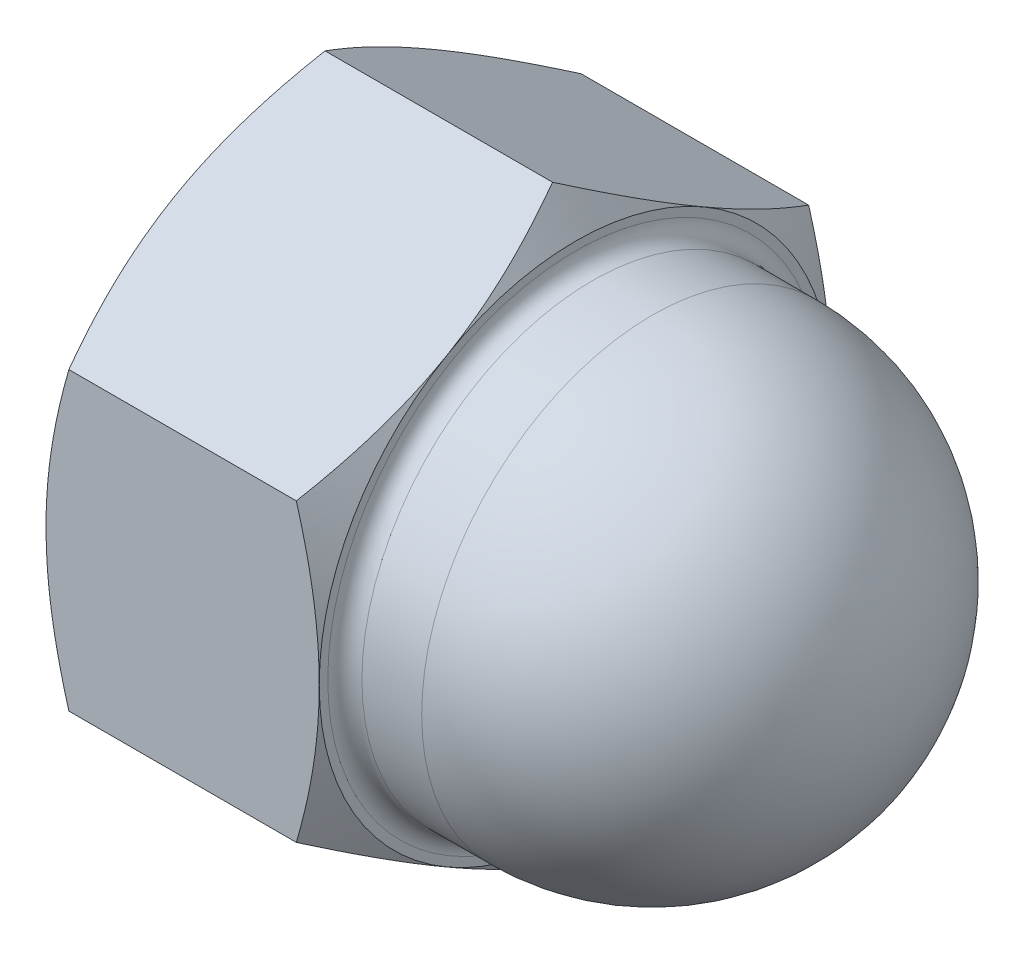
ISO-10303-21;
HEADER;
FILE_DESCRIPTION(('STEP AP214'),'2;1');
FILE_NAME('part.step','',(''),(''),'','','');
FILE_SCHEMA(('AUTOMOTIVE_DESIGN { 1 0 10303 214 1 1 1 1 }'));
ENDSEC;
DATA;
#1=APPLICATION_CONTEXT('core data for automotive mechanical design processes');
#2=APPLICATION_PROTOCOL_DEFINITION('international standard','automotive_design',2000,#1);
#3=PRODUCT_CONTEXT('',#1,'mechanical');
#4=PRODUCT('Part','Part','',(#3));
#5=PRODUCT_RELATED_PRODUCT_CATEGORY('part','',(#4));
#6=PRODUCT_DEFINITION_FORMATION('','',#4);
#7=PRODUCT_DEFINITION_CONTEXT('part definition',#1,'design');
#8=PRODUCT_DEFINITION('design','',#6,#7);
#9=PRODUCT_DEFINITION_SHAPE('','',#8);
#10=(LENGTH_UNIT() NAMED_UNIT(*) SI_UNIT(.MILLI.,.METRE.));
#11=(NAMED_UNIT(*) PLANE_ANGLE_UNIT() SI_UNIT($,.RADIAN.));
#12=(NAMED_UNIT(*) SI_UNIT($,.STERADIAN.) SOLID_ANGLE_UNIT());
#13=UNCERTAINTY_MEASURE_WITH_UNIT(LENGTH_MEASURE(1.E-05),#10,'distance_accuracy_value','');
#14=(GEOMETRIC_REPRESENTATION_CONTEXT(3) GLOBAL_UNCERTAINTY_ASSIGNED_CONTEXT((#13)) GLOBAL_UNIT_ASSIGNED_CONTEXT((#10,
#11,#12)) REPRESENTATION_CONTEXT('',''));
#15=CARTESIAN_POINT('',(0.,0.,0.));
#16=DIRECTION('',(0.,0.,1.));
#17=DIRECTION('',(1.,0.,0.));
#18=AXIS2_PLACEMENT_3D('',#15,#16,#17);
#19=CARTESIAN_POINT('',(16.,17.3205080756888,0.));
#20=DIRECTION('',(-1.,0.,0.));
#21=DIRECTION('',(0.,0.,1.));
#22=AXIS2_PLACEMENT_3D('',#19,#20,#21);
#23=PLANE('',#22);
#24=CARTESIAN_POINT('',(16.,0.,0.));
#25=DIRECTION('',(-1.,0.,0.));
#26=DIRECTION('',(0.,0.,1.));
#27=AXIS2_PLACEMENT_3D('',#24,#25,#26);
#28=CIRCLE('',#27,14.5);
#29=CARTESIAN_POINT('',(16.,0.,14.5));
#30=VERTEX_POINT('',#29);
#31=EDGE_CURVE('E11',#30,#30,#28,.T.);
#32=ORIENTED_EDGE('',*,*,#31,.T.);
#33=EDGE_LOOP('',(#32));
#34=FACE_BOUND('',#33,.T.);
#35=CARTESIAN_POINT('',(16.,0.,0.));
#36=DIRECTION('',(-1.,0.,0.));
#37=DIRECTION('',(0.,0.,1.));
#38=AXIS2_PLACEMENT_3D('',#35,#36,#37);
#39=CIRCLE('',#38,15.);
#40=CARTESIAN_POINT('',(16.,0.,15.));
#41=VERTEX_POINT('',#40);
#42=CARTESIAN_POINT('',(16.,12.9903810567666,7.49999999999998));
#43=VERTEX_POINT('',#42);
#44=EDGE_CURVE('E355',#41,#43,#39,.T.);
#45=ORIENTED_EDGE('',*,*,#44,.F.);
#46=CARTESIAN_POINT('',(16.,0.,0.));
#47=DIRECTION('',(-1.,0.,0.));
#48=DIRECTION('',(0.,0.,1.));
#49=AXIS2_PLACEMENT_3D('',#46,#47,#48);
#50=CIRCLE('',#49,15.);
#51=CARTESIAN_POINT('',(16.,-12.9903810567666,7.50000000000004));
#52=VERTEX_POINT('',#51);
#53=EDGE_CURVE('E322',#52,#41,#50,.T.);
#54=ORIENTED_EDGE('',*,*,#53,.F.);
#55=CARTESIAN_POINT('',(16.,-12.9903810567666,-7.49999999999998));
#56=VERTEX_POINT('',#55);
#57=EDGE_CURVE('E325',#56,#52,#50,.T.);
#58=ORIENTED_EDGE('',*,*,#57,.F.);
#59=CARTESIAN_POINT('',(16.,0.,-15.));
#60=VERTEX_POINT('',#59);
#61=EDGE_CURVE('E339',#60,#56,#50,.T.);
#62=ORIENTED_EDGE('',*,*,#61,.F.);
#63=CARTESIAN_POINT('',(16.,12.9903810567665,-7.50000000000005));
#64=VERTEX_POINT('',#63);
#65=EDGE_CURVE('E336',#64,#60,#50,.T.);
#66=ORIENTED_EDGE('',*,*,#65,.F.);
#67=EDGE_CURVE('E326',#43,#64,#50,.T.);
#68=ORIENTED_EDGE('',*,*,#67,.F.);
#69=EDGE_LOOP('',(#45,#54,#58,#62,#66,#68));
#70=FACE_BOUND('',#69,.T.);
#71=ADVANCED_FACE('F35',(#34,#70),#23,.F.);
#72=CARTESIAN_POINT('',(0.,0.,0.));
#73=DIRECTION('',(-1.,0.,0.));
#74=DIRECTION('',(0.,0.,1.));
#75=AXIS2_PLACEMENT_3D('',#72,#73,#74);
#76=CYLINDRICAL_SURFACE('',#75,13.5);
#77=CARTESIAN_POINT('',(17.,0.,0.));
#78=DIRECTION('',(-1.,0.,0.));
#79=DIRECTION('',(0.,0.,1.));
#80=AXIS2_PLACEMENT_3D('',#77,#78,#79);
#81=CIRCLE('',#80,13.5);
#82=CARTESIAN_POINT('',(17.,0.,13.5));
#83=VERTEX_POINT('',#82);
#84=EDGE_CURVE('E43',#83,#83,#81,.F.);
#85=ORIENTED_EDGE('',*,*,#84,.T.);
#86=EDGE_LOOP('',(#85));
#87=FACE_BOUND('',#86,.T.);
#88=CARTESIAN_POINT('',(20.5,0.,0.));
#89=DIRECTION('',(-1.,0.,0.));
#90=DIRECTION('',(0.,0.,1.));
#91=AXIS2_PLACEMENT_3D('',#88,#89,#90);
#92=CIRCLE('',#91,13.5);
#93=CARTESIAN_POINT('',(20.5,0.,13.5));
#94=VERTEX_POINT('',#93);
#95=EDGE_CURVE('E299',#94,#94,#92,.T.);
#96=ORIENTED_EDGE('',*,*,#95,.T.);
#97=EDGE_LOOP('',(#96));
#98=FACE_BOUND('',#97,.T.);
#99=ADVANCED_FACE('F145',(#87,#98),#76,.T.);
#100=CARTESIAN_POINT('',(20.5,0.,0.));
#101=DIRECTION('',(-1.,0.,0.));
#102=DIRECTION('',(0.,1.,0.));
#103=AXIS2_PLACEMENT_3D('',#100,#101,#102);
#104=SPHERICAL_SURFACE('',#103,13.5);
#105=ORIENTED_EDGE('',*,*,#95,.F.);
#106=EDGE_LOOP('',(#105));
#107=FACE_BOUND('',#106,.T.);
#108=ADVANCED_FACE('F151',(#107),#104,.T.);
#109=CARTESIAN_POINT('',(13.2168783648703,0.,0.));
#110=DIRECTION('',(-1.,0.,0.));
#111=DIRECTION('',(0.,0.,1.));
#112=AXIS2_PLACEMENT_3D('',#109,#110,#111);
#113=CONICAL_SURFACE('',#112,19.8205080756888,1.0471975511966);
#114=CARTESIAN_POINT('',(8.72490551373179,-23.1690741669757,15.));
#115=CARTESIAN_POINT('',(8.88346375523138,-22.8419055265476,15.));
#116=CARTESIAN_POINT('',(9.04122421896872,-22.5143504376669,15.));
#117=CARTESIAN_POINT('',(9.35496872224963,-21.8583866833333,15.));
#118=CARTESIAN_POINT('',(9.5109527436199,-21.5299780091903,15.));
#119=CARTESIAN_POINT('',(9.97601055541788,-20.5432618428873,15.));
#120=CARTESIAN_POINT('',(10.2821423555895,-19.8835624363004,15.));
#121=CARTESIAN_POINT('',(10.8863599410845,-18.5560823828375,15.));
#122=CARTESIAN_POINT('',(11.1843920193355,-17.8882772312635,15.));
#123=CARTESIAN_POINT('',(11.7681393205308,-16.5473234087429,15.));
#124=CARTESIAN_POINT('',(12.0538551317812,-15.8741749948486,15.));
#125=CARTESIAN_POINT('',(12.6184951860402,-14.5000785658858,15.));
#126=CARTESIAN_POINT('',(12.8969197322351,-13.7989241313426,15.));
#127=CARTESIAN_POINT('',(13.4324703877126,-12.3883726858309,15.));
#128=CARTESIAN_POINT('',(13.6895940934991,-11.6789747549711,15.));
#129=CARTESIAN_POINT('',(14.1757206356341,-10.2521895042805,15.));
#130=CARTESIAN_POINT('',(14.4047812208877,-9.53482202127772,15.));
#131=CARTESIAN_POINT('',(14.8273819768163,-8.08972904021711,15.));
#132=CARTESIAN_POINT('',(15.0209334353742,-7.36200691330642,15.));
#133=CARTESIAN_POINT('',(15.2770501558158,-6.26455118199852,15.));
#134=CARTESIAN_POINT('',(15.3565523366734,-5.89874555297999,15.));
#135=CARTESIAN_POINT('',(15.5031975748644,-5.1646524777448,15.));
#136=CARTESIAN_POINT('',(15.5703408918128,-4.79636508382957,15.));
#137=CARTESIAN_POINT('',(15.691077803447,-4.05756782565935,15.));
#138=CARTESIAN_POINT('',(15.7446715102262,-3.68705797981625,15.));
#139=CARTESIAN_POINT('',(15.8372361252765,-2.9442191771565,15.));
#140=CARTESIAN_POINT('',(15.8762076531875,-2.57189029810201,15.));
#141=CARTESIAN_POINT('',(15.9382707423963,-1.83075081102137,15.));
#142=CARTESIAN_POINT('',(15.961561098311,-1.46195695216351,15.));
#143=CARTESIAN_POINT('',(15.992531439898,-0.723715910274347,15.));
#144=CARTESIAN_POINT('',(16.000211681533,-0.354268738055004,15.));
#145=CARTESIAN_POINT('',(15.999779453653,0.384620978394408,15.));
#146=CARTESIAN_POINT('',(15.9916668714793,0.754063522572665,15.));
#147=CARTESIAN_POINT('',(15.9598452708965,1.49227999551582,15.));
#148=CARTESIAN_POINT('',(15.9361355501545,1.86105389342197,15.));
#149=CARTESIAN_POINT('',(15.8606650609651,2.75020108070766,15.));
#150=CARTESIAN_POINT('',(15.8013447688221,3.26994378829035,15.));
#151=CARTESIAN_POINT('',(15.6549761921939,4.30551289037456,15.));
#152=CARTESIAN_POINT('',(15.5679240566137,4.82133873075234,15.));
#153=CARTESIAN_POINT('',(15.3691887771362,5.84860326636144,15.));
#154=CARTESIAN_POINT('',(15.2574861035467,6.36003814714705,15.));
#155=CARTESIAN_POINT('',(15.0128532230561,7.37774872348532,15.));
#156=CARTESIAN_POINT('',(14.8799233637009,7.88402450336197,15.));
#157=CARTESIAN_POINT('',(14.5929500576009,8.90245513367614,15.));
#158=CARTESIAN_POINT('',(14.4385092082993,9.41449722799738,15.));
#159=CARTESIAN_POINT('',(14.113878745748,10.4335364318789,15.));
#160=CARTESIAN_POINT('',(13.9436890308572,10.9405335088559,15.));
#161=CARTESIAN_POINT('',(13.5902447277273,11.9497365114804,15.));
#162=CARTESIAN_POINT('',(13.406994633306,12.4519440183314,15.));
#163=CARTESIAN_POINT('',(13.0295649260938,13.4522120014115,15.));
#164=CARTESIAN_POINT('',(12.8353854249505,13.9502725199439,15.));
#165=CARTESIAN_POINT('',(12.3752305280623,15.0992288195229,15.));
#166=CARTESIAN_POINT('',(12.105925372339,15.7487887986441,15.));
#167=CARTESIAN_POINT('',(11.5547925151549,17.0425896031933,15.));
#168=CARTESIAN_POINT('',(11.2729641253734,17.6868301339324,15.));
#169=CARTESIAN_POINT('',(10.6992189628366,18.9709471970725,15.));
#170=CARTESIAN_POINT('',(10.4073001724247,19.6108228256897,15.));
#171=CARTESIAN_POINT('',(9.81534813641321,20.8867861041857,15.));
#172=CARTESIAN_POINT('',(9.51531504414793,21.5228738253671,15.));
#173=CARTESIAN_POINT('',(8.9083023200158,22.7925136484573,15.));
#174=CARTESIAN_POINT('',(8.60131594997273,23.4260625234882,15.));
#175=CARTESIAN_POINT('',(7.98185068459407,24.690468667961,15.));
#176=CARTESIAN_POINT('',(7.66937176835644,25.3213259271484,15.));
#177=CARTESIAN_POINT('',(7.03987592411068,26.580678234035,15.));
#178=CARTESIAN_POINT('',(6.72285952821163,27.2091735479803,15.));
#179=CARTESIAN_POINT('',(6.08497726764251,28.4642087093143,15.));
#180=CARTESIAN_POINT('',(5.76411138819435,29.0907485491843,15.));
#181=CARTESIAN_POINT('',(4.84852370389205,30.8671956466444,15.));
#182=CARTESIAN_POINT('',(4.24993335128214,32.0151090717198,15.));
#183=CARTESIAN_POINT('',(3.04449894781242,34.3066304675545,15.));
#184=CARTESIAN_POINT('',(2.43765463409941,35.4502382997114,15.));
#185=CARTESIAN_POINT('',(1.21904159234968,37.73139285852,15.));
#186=CARTESIAN_POINT('',(0.607287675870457,38.868947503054,15.));
#187=CARTESIAN_POINT('',(-0.314051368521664,40.5732346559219,15.));
#188=CARTESIAN_POINT('',(-0.621774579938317,41.1409752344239,15.));
#189=CARTESIAN_POINT('',(-1.23833467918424,42.275850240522,15.));
#190=CARTESIAN_POINT('',(-1.54717156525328,42.8429846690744,15.));
#191=CARTESIAN_POINT('',(-1.85650205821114,43.4098498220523,15.));
#192=B_SPLINE_CURVE_WITH_KNOTS('',3,(#114,#115,#116,#117,#118,#119,#120,#121,#122,#123,#124,
#125,#126,#127,#128,#129,#130,#131,#132,#133,#134,#135,#136,#137,#138,#139,#140,#141,#142,#143,
#144,#145,#146,#147,#148,#149,#150,#151,#152,#153,#154,#155,#156,#157,#158,#159,#160,#161,#162,
#163,#164,#165,#166,#167,#168,#169,#170,#171,#172,#173,#174,#175,#176,#177,#178,#179,#180,#181,
#182,#183,#184,#185,#186,#187,#188,#189,#190,#191),.UNSPECIFIED.,.F.,.F.,(4,2,2,2,2,2,2,2,2,2,2,
2,2,2,2,2,2,2,2,2,2,2,2,2,2,2,2,2,2,2,2,2,2,2,2,2,2,2,4),(0.,1.09069516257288,2.18140147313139,
4.36314172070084,6.55691851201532,8.75059039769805,11.0135627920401,13.2767901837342,
15.5352791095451,17.7930488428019,18.9159095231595,20.0387466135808,21.1615744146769,
22.2843546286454,23.3926186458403,24.5008644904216,25.6091182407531,26.7174218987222,
28.2859027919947,29.8546015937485,31.4245477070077,32.9944681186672,34.5986435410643,
36.2028293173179,37.8064657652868,39.4100858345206,41.5194319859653,43.6288942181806,
45.7387807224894,47.8486273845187,49.9606143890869,52.0726094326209,54.1843587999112,
56.2961162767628,60.1798964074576,64.063800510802,67.9386334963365,69.8759519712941,
71.8132673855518),.UNSPECIFIED.);
#193=CARTESIAN_POINT('',(14.6602540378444,-8.66025403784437,15.));
#194=VERTEX_POINT('',#193);
#195=EDGE_CURVE('E238',#41,#194,#192,.F.);
#196=ORIENTED_EDGE('',*,*,#195,.T.);
#197=CARTESIAN_POINT('',(14.6601873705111,-8.66013856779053,15.0002));
#198=CARTESIAN_POINT('',(14.7700782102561,-8.85048754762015,14.6705058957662));
#199=CARTESIAN_POINT('',(14.8749824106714,-9.04157899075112,14.3395258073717));
#200=CARTESIAN_POINT('',(15.0734314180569,-9.42529420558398,13.674911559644));
#201=CARTESIAN_POINT('',(15.1669724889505,-9.617918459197,13.3412765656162));
#202=CARTESIAN_POINT('',(15.3414378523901,-10.0050715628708,12.6707077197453));
#203=CARTESIAN_POINT('',(15.4223322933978,-10.199603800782,12.333767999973));
#204=CARTESIAN_POINT('',(15.569767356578,-10.5900200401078,11.6575472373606));
#205=CARTESIAN_POINT('',(15.6363087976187,-10.7859039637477,11.3182663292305));
#206=CARTESIAN_POINT('',(15.7522076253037,-11.1740042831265,10.6460568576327));
#207=CARTESIAN_POINT('',(15.8019486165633,-11.3661918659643,10.3131781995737));
#208=CARTESIAN_POINT('',(15.8853532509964,-11.7514476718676,9.64589556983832));
#209=CARTESIAN_POINT('',(15.9190165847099,-11.9445159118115,9.31149156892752));
#210=CARTESIAN_POINT('',(15.9694159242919,-12.3309767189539,8.64212181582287));
#211=CARTESIAN_POINT('',(15.9861720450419,-12.5243686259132,8.30715720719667));
#212=CARTESIAN_POINT('',(16.002396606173,-12.9113309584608,7.63691878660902));
#213=CARTESIAN_POINT('',(16.0018655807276,-13.1049013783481,7.30164498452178));
#214=CARTESIAN_POINT('',(15.9847233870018,-13.4667798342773,6.67485311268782));
#215=CARTESIAN_POINT('',(15.970203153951,-13.6351136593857,6.3832903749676));
#216=CARTESIAN_POINT('',(15.9283628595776,-13.9713941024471,5.80083556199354));
#217=CARTESIAN_POINT('',(15.9010418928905,-14.1393406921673,5.50994353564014));
#218=CARTESIAN_POINT('',(15.8340764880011,-14.4747554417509,4.9289881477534));
#219=CARTESIAN_POINT('',(15.7944218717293,-14.6422230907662,4.63892567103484));
#220=CARTESIAN_POINT('',(15.7034848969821,-14.9763732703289,4.06016058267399));
#221=CARTESIAN_POINT('',(15.6522017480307,-15.1430557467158,3.77145806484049));
#222=CARTESIAN_POINT('',(15.4796131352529,-15.6490296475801,2.89508556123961));
#223=CARTESIAN_POINT('',(15.3410988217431,-15.9868558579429,2.30995340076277));
#224=CARTESIAN_POINT('',(15.0267280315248,-16.6574708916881,1.14841408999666));
#225=CARTESIAN_POINT('',(14.8509453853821,-16.9902683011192,0.571992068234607));
#226=CARTESIAN_POINT('',(14.6601873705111,-17.3206235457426,-0.00019999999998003));
#227=B_SPLINE_CURVE_WITH_KNOTS('',3,(#197,#198,#199,#200,#201,#202,#203,#204,#205,#206,#207,
#208,#209,#210,#211,#212,#213,#214,#215,#216,#217,#218,#219,#220,#221,#222,#223,#224,#225,#226),
.UNSPECIFIED.,.F.,.F.,(4,2,2,2,2,2,2,2,2,2,2,2,2,2,4),(0.,1.18875411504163,2.37789802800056,
3.56980778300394,4.76164951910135,5.92407379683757,7.0865204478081,8.24758247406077,
9.40860862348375,10.4193068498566,11.4300765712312,12.4416826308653,13.4533574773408,
15.5211962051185,17.5849760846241),.UNSPECIFIED.);
#228=EDGE_CURVE('E236',#194,#52,#227,.T.);
#229=ORIENTED_EDGE('',*,*,#228,.T.);
#230=ORIENTED_EDGE('',*,*,#53,.T.);
#231=EDGE_LOOP('',(#196,#229,#230));
#232=FACE_BOUND('',#231,.T.);
#233=ADVANCED_FACE('F351',(#232),#113,.T.);
#234=CARTESIAN_POINT('',(14.6602540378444,-17.3205080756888,0.));
#235=VERTEX_POINT('',#234);
#236=EDGE_CURVE('E230',#52,#235,#227,.T.);
#237=ORIENTED_EDGE('',*,*,#236,.T.);
#238=CARTESIAN_POINT('',(14.6601873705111,-17.3206235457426,0.000200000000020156));
#239=CARTESIAN_POINT('',(14.7700782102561,-17.130274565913,-0.329494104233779));
#240=CARTESIAN_POINT('',(14.8749824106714,-16.9391831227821,-0.66047419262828));
#241=CARTESIAN_POINT('',(15.0734314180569,-16.5554679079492,-1.325088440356));
#242=CARTESIAN_POINT('',(15.1669724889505,-16.3628436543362,-1.65872343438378));
#243=CARTESIAN_POINT('',(15.3414378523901,-15.9756905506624,-2.32929228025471));
#244=CARTESIAN_POINT('',(15.4223322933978,-15.7811583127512,-2.66623200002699));
#245=CARTESIAN_POINT('',(15.5697673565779,-15.3907420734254,-3.34245276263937));
#246=CARTESIAN_POINT('',(15.6363087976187,-15.1948581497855,-3.6817336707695));
#247=CARTESIAN_POINT('',(15.7522076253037,-14.8067578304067,-4.3539431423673));
#248=CARTESIAN_POINT('',(15.8019486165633,-14.6145702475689,-4.68682180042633));
#249=CARTESIAN_POINT('',(15.8853532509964,-14.2293144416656,-5.35410443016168));
#250=CARTESIAN_POINT('',(15.9190165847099,-14.0362462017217,-5.68850843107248));
#251=CARTESIAN_POINT('',(15.9694159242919,-13.6497853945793,-6.35787818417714));
#252=CARTESIAN_POINT('',(15.9861720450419,-13.45639348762,-6.69284279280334));
#253=CARTESIAN_POINT('',(16.002396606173,-13.0694311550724,-7.363081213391));
#254=CARTESIAN_POINT('',(16.0018655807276,-12.8758607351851,-7.69835501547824));
#255=CARTESIAN_POINT('',(15.9847233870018,-12.5139822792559,-8.3251468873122));
#256=CARTESIAN_POINT('',(15.970203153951,-12.3456484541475,-8.61670962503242));
#257=CARTESIAN_POINT('',(15.9283628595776,-12.0093680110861,-9.19916443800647));
#258=CARTESIAN_POINT('',(15.9010418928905,-11.8414214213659,-9.49005646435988));
#259=CARTESIAN_POINT('',(15.8340764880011,-11.5060066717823,-10.0710118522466));
#260=CARTESIAN_POINT('',(15.7944218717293,-11.338539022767,-10.3610743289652));
#261=CARTESIAN_POINT('',(15.7034848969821,-11.0043888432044,-10.939839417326));
#262=CARTESIAN_POINT('',(15.6522017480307,-10.8377063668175,-11.2285419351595));
#263=CARTESIAN_POINT('',(15.4796131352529,-10.3317324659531,-12.1049144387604));
#264=CARTESIAN_POINT('',(15.3410988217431,-9.99390625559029,-12.6900465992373));
#265=CARTESIAN_POINT('',(15.0267280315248,-9.32329122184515,-13.8515859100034));
#266=CARTESIAN_POINT('',(14.8509453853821,-8.99049381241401,-14.4280079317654));
#267=CARTESIAN_POINT('',(14.6601873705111,-8.6601385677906,-15.0002));
#268=B_SPLINE_CURVE_WITH_KNOTS('',3,(#238,#239,#240,#241,#242,#243,#244,#245,#246,#247,#248,
#249,#250,#251,#252,#253,#254,#255,#256,#257,#258,#259,#260,#261,#262,#263,#264,#265,#266,#267),
.UNSPECIFIED.,.F.,.F.,(4,2,2,2,2,2,2,2,2,2,2,2,2,2,4),(0.,1.18875411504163,2.37789802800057,
3.56980778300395,4.76164951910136,5.92407379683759,7.08652044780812,8.24758247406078,
9.40860862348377,10.4193068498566,11.4300765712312,12.4416826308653,13.4533574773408,
15.5211962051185,17.5849760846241),.UNSPECIFIED.);
#269=EDGE_CURVE('E237',#235,#56,#268,.T.);
#270=ORIENTED_EDGE('',*,*,#269,.T.);
#271=ORIENTED_EDGE('',*,*,#57,.T.);
#272=EDGE_LOOP('',(#237,#270,#271));
#273=FACE_BOUND('',#272,.T.);
#274=ADVANCED_FACE('F344',(#273),#113,.T.);
#275=CARTESIAN_POINT('',(14.6602540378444,-8.66025403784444,-15.));
#276=VERTEX_POINT('',#275);
#277=EDGE_CURVE('E224',#56,#276,#268,.T.);
#278=ORIENTED_EDGE('',*,*,#277,.T.);
#279=CARTESIAN_POINT('',(8.72490551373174,-23.1690741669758,-15.));
#280=CARTESIAN_POINT('',(8.88346375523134,-22.8419055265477,-15.));
#281=CARTESIAN_POINT('',(9.04122421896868,-22.514350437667,-15.));
#282=CARTESIAN_POINT('',(9.35496872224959,-21.8583866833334,-15.));
#283=CARTESIAN_POINT('',(9.51095274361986,-21.5299780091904,-15.));
#284=CARTESIAN_POINT('',(9.97601055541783,-20.5432618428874,-15.));
#285=CARTESIAN_POINT('',(10.2821423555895,-19.8835624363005,-15.));
#286=CARTESIAN_POINT('',(10.8863599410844,-18.5560823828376,-15.));
#287=CARTESIAN_POINT('',(11.1843920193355,-17.8882772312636,-15.));
#288=CARTESIAN_POINT('',(11.7681393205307,-16.5473234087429,-15.));
#289=CARTESIAN_POINT('',(12.0538551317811,-15.8741749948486,-15.));
#290=CARTESIAN_POINT('',(12.6184951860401,-14.5000785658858,-15.));
#291=CARTESIAN_POINT('',(12.896919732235,-13.7989241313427,-15.));
#292=CARTESIAN_POINT('',(13.4324703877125,-12.3883726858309,-15.));
#293=CARTESIAN_POINT('',(13.6895940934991,-11.6789747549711,-15.));
#294=CARTESIAN_POINT('',(14.1757206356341,-10.2521895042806,-15.));
#295=CARTESIAN_POINT('',(14.4047812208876,-9.53482202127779,-15.));
#296=CARTESIAN_POINT('',(14.8273819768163,-8.08972904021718,-15.));
#297=CARTESIAN_POINT('',(15.0209334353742,-7.3620069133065,-15.));
#298=CARTESIAN_POINT('',(15.2770501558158,-6.2645511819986,-15.));
#299=CARTESIAN_POINT('',(15.3565523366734,-5.89874555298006,-15.));
#300=CARTESIAN_POINT('',(15.5031975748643,-5.16465247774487,-15.));
#301=CARTESIAN_POINT('',(15.5703408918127,-4.79636508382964,-15.));
#302=CARTESIAN_POINT('',(15.691077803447,-4.05756782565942,-15.));
#303=CARTESIAN_POINT('',(15.7446715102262,-3.68705797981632,-15.));
#304=CARTESIAN_POINT('',(15.8372361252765,-2.94421917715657,-15.));
#305=CARTESIAN_POINT('',(15.8762076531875,-2.57189029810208,-15.));
#306=CARTESIAN_POINT('',(15.9382707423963,-1.83075081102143,-15.));
#307=CARTESIAN_POINT('',(15.961561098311,-1.46195695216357,-15.));
#308=CARTESIAN_POINT('',(15.992531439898,-0.723715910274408,-15.));
#309=CARTESIAN_POINT('',(16.000211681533,-0.354268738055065,-15.));
#310=CARTESIAN_POINT('',(15.999779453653,0.38462097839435,-15.));
#311=CARTESIAN_POINT('',(15.9916668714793,0.754063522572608,-15.));
#312=CARTESIAN_POINT('',(15.9598452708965,1.49227999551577,-15.));
#313=CARTESIAN_POINT('',(15.9361355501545,1.86105389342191,-15.));
#314=CARTESIAN_POINT('',(15.8606650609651,2.75020108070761,-15.));
#315=CARTESIAN_POINT('',(15.8013447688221,3.26994378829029,-15.));
#316=CARTESIAN_POINT('',(15.6549761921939,4.30551289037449,-15.));
#317=CARTESIAN_POINT('',(15.5679240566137,4.82133873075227,-15.));
#318=CARTESIAN_POINT('',(15.3691887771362,5.84860326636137,-15.));
#319=CARTESIAN_POINT('',(15.2574861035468,6.36003814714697,-15.));
#320=CARTESIAN_POINT('',(15.0128532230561,7.37774872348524,-15.));
#321=CARTESIAN_POINT('',(14.879923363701,7.88402450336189,-15.));
#322=CARTESIAN_POINT('',(14.5929500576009,8.90245513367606,-15.));
#323=CARTESIAN_POINT('',(14.4385092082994,9.41449722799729,-15.));
#324=CARTESIAN_POINT('',(14.1138787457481,10.4335364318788,-15.));
#325=CARTESIAN_POINT('',(13.9436890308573,10.9405335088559,-15.));
#326=CARTESIAN_POINT('',(13.5902447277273,11.9497365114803,-15.));
#327=CARTESIAN_POINT('',(13.406994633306,12.4519440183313,-15.));
#328=CARTESIAN_POINT('',(13.0295649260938,13.4522120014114,-15.));
#329=CARTESIAN_POINT('',(12.8353854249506,13.9502725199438,-15.));
#330=CARTESIAN_POINT('',(12.3752305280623,15.0992288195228,-15.));
#331=CARTESIAN_POINT('',(12.105925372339,15.748788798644,-15.));
#332=CARTESIAN_POINT('',(11.5547925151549,17.0425896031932,-15.));
#333=CARTESIAN_POINT('',(11.2729641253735,17.6868301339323,-15.));
#334=CARTESIAN_POINT('',(10.6992189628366,18.9709471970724,-15.));
#335=CARTESIAN_POINT('',(10.4073001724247,19.6108228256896,-15.));
#336=CARTESIAN_POINT('',(9.81534813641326,20.8867861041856,-15.));
#337=CARTESIAN_POINT('',(9.51531504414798,21.522873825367,-15.));
#338=CARTESIAN_POINT('',(8.90830232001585,22.7925136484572,-15.));
#339=CARTESIAN_POINT('',(8.60131594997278,23.4260625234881,-15.));
#340=CARTESIAN_POINT('',(7.98185068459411,24.6904686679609,-15.));
#341=CARTESIAN_POINT('',(7.66937176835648,25.3213259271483,-15.));
#342=CARTESIAN_POINT('',(7.03987592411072,26.5806782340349,-15.));
#343=CARTESIAN_POINT('',(6.72285952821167,27.2091735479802,-15.));
#344=CARTESIAN_POINT('',(6.08497726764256,28.4642087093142,-15.));
#345=CARTESIAN_POINT('',(5.76411138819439,29.0907485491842,-15.));
#346=CARTESIAN_POINT('',(4.8485237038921,30.8671956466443,-15.));
#347=CARTESIAN_POINT('',(4.24993335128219,32.0151090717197,-15.));
#348=CARTESIAN_POINT('',(3.04449894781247,34.3066304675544,-15.));
#349=CARTESIAN_POINT('',(2.43765463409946,35.4502382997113,-15.));
#350=CARTESIAN_POINT('',(1.21904159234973,37.73139285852,-15.));
#351=CARTESIAN_POINT('',(0.607287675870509,38.8689475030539,-15.));
#352=CARTESIAN_POINT('',(-0.314051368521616,40.5732346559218,-15.));
#353=CARTESIAN_POINT('',(-0.621774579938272,41.1409752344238,-15.));
#354=CARTESIAN_POINT('',(-1.23833467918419,42.2758502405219,-15.));
#355=CARTESIAN_POINT('',(-1.54717156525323,42.8429846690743,-15.));
#356=CARTESIAN_POINT('',(-1.85650205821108,43.4098498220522,-15.));
#357=B_SPLINE_CURVE_WITH_KNOTS('',3,(#279,#280,#281,#282,#283,#284,#285,#286,#287,#288,#289,
#290,#291,#292,#293,#294,#295,#296,#297,#298,#299,#300,#301,#302,#303,#304,#305,#306,#307,#308,
#309,#310,#311,#312,#313,#314,#315,#316,#317,#318,#319,#320,#321,#322,#323,#324,#325,#326,#327,
#328,#329,#330,#331,#332,#333,#334,#335,#336,#337,#338,#339,#340,#341,#342,#343,#344,#345,#346,
#347,#348,#349,#350,#351,#352,#353,#354,#355,#356),.UNSPECIFIED.,.F.,.F.,(4,2,2,2,2,2,2,2,2,2,2,
2,2,2,2,2,2,2,2,2,2,2,2,2,2,2,2,2,2,2,2,2,2,2,2,2,2,2,4),(0.,1.09069516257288,2.18140147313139,
4.36314172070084,6.55691851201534,8.75059039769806,11.0135627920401,13.2767901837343,
15.5352791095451,17.7930488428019,18.9159095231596,20.0387466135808,21.161574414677,
22.2843546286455,23.3926186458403,24.5008644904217,25.6091182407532,26.7174218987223,
28.2859027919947,29.8546015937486,31.4245477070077,32.9944681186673,34.5986435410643,
36.2028293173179,37.8064657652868,39.4100858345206,41.5194319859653,43.6288942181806,
45.7387807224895,47.8486273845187,49.9606143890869,52.0726094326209,54.1843587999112,
56.2961162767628,60.1798964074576,64.0638005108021,67.9386334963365,69.8759519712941,
71.8132673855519),.UNSPECIFIED.);
#358=EDGE_CURVE('E58',#60,#276,#357,.F.);
#359=ORIENTED_EDGE('',*,*,#358,.F.);
#360=ORIENTED_EDGE('',*,*,#61,.T.);
#361=EDGE_LOOP('',(#278,#359,#360));
#362=FACE_BOUND('',#361,.T.);
#363=ADVANCED_FACE('F209',(#362),#113,.T.);
#364=CARTESIAN_POINT('',(14.6601873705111,8.66013856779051,-15.0002));
#365=CARTESIAN_POINT('',(14.7700782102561,8.85048754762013,-14.6705058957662));
#366=CARTESIAN_POINT('',(14.8749824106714,9.0415789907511,-14.3395258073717));
#367=CARTESIAN_POINT('',(15.0734314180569,9.42529420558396,-13.674911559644));
#368=CARTESIAN_POINT('',(15.1669724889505,9.61791845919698,-13.3412765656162));
#369=CARTESIAN_POINT('',(15.3414378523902,10.0050715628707,-12.6707077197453));
#370=CARTESIAN_POINT('',(15.4223322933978,10.1996038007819,-12.333767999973));
#371=CARTESIAN_POINT('',(15.569767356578,10.5900200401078,-11.6575472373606));
#372=CARTESIAN_POINT('',(15.6363087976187,10.7859039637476,-11.3182663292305));
#373=CARTESIAN_POINT('',(15.7522076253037,11.1740042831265,-10.6460568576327));
#374=CARTESIAN_POINT('',(15.8019486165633,11.3661918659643,-10.3131781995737));
#375=CARTESIAN_POINT('',(15.8853532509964,11.7514476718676,-9.64589556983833));
#376=CARTESIAN_POINT('',(15.9190165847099,11.9445159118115,-9.31149156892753));
#377=CARTESIAN_POINT('',(15.9694159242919,12.3309767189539,-8.64212181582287));
#378=CARTESIAN_POINT('',(15.986172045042,12.5243686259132,-8.30715720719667));
#379=CARTESIAN_POINT('',(16.002396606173,12.9113309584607,-7.63691878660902));
#380=CARTESIAN_POINT('',(16.0018655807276,13.104901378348,-7.30164498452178));
#381=CARTESIAN_POINT('',(15.9847233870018,13.4667798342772,-6.67485311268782));
#382=CARTESIAN_POINT('',(15.970203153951,13.6351136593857,-6.3832903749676));
#383=CARTESIAN_POINT('',(15.9283628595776,13.9713941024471,-5.80083556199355));
#384=CARTESIAN_POINT('',(15.9010418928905,14.1393406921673,-5.50994353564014));
#385=CARTESIAN_POINT('',(15.8340764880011,14.4747554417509,-4.9289881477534));
#386=CARTESIAN_POINT('',(15.7944218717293,14.6422230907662,-4.63892567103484));
#387=CARTESIAN_POINT('',(15.7034848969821,14.9763732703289,-4.06016058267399));
#388=CARTESIAN_POINT('',(15.6522017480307,15.1430557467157,-3.77145806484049));
#389=CARTESIAN_POINT('',(15.4796131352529,15.6490296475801,-2.89508556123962));
#390=CARTESIAN_POINT('',(15.3410988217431,15.9868558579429,-2.30995340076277));
#391=CARTESIAN_POINT('',(15.0267280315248,16.6574708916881,-1.14841408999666));
#392=CARTESIAN_POINT('',(14.8509453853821,16.9902683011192,-0.571992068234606));
#393=CARTESIAN_POINT('',(14.6601873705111,17.3206235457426,0.000199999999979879));
#394=B_SPLINE_CURVE_WITH_KNOTS('',3,(#364,#365,#366,#367,#368,#369,#370,#371,#372,#373,#374,
#375,#376,#377,#378,#379,#380,#381,#382,#383,#384,#385,#386,#387,#388,#389,#390,#391,#392,#393),
.UNSPECIFIED.,.F.,.F.,(4,2,2,2,2,2,2,2,2,2,2,2,2,2,4),(0.,1.18875411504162,2.37789802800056,
3.56980778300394,4.76164951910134,5.92407379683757,7.0865204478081,8.24758247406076,
9.40860862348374,10.4193068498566,11.4300765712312,12.4416826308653,13.4533574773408,
15.5211962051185,17.5849760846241),.UNSPECIFIED.);
#395=CARTESIAN_POINT('',(14.6602540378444,8.66025403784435,-15.));
#396=VERTEX_POINT('',#395);
#397=EDGE_CURVE('E190',#396,#64,#394,.T.);
#398=ORIENTED_EDGE('',*,*,#397,.T.);
#399=ORIENTED_EDGE('',*,*,#65,.T.);
#400=EDGE_CURVE('E199',#396,#60,#357,.F.);
#401=ORIENTED_EDGE('',*,*,#400,.F.);
#402=EDGE_LOOP('',(#398,#399,#401));
#403=FACE_BOUND('',#402,.T.);
#404=ADVANCED_FACE('F205',(#403),#113,.T.);
#405=CARTESIAN_POINT('',(14.6601873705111,17.3206235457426,-0.000200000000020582));
#406=CARTESIAN_POINT('',(14.7700782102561,17.130274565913,0.329494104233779));
#407=CARTESIAN_POINT('',(14.8749824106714,16.939183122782,0.66047419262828));
#408=CARTESIAN_POINT('',(15.0734314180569,16.5554679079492,1.325088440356));
#409=CARTESIAN_POINT('',(15.1669724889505,16.3628436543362,1.65872343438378));
#410=CARTESIAN_POINT('',(15.3414378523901,15.9756905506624,2.32929228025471));
#411=CARTESIAN_POINT('',(15.4223322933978,15.7811583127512,2.66623200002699));
#412=CARTESIAN_POINT('',(15.5697673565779,15.3907420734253,3.34245276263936));
#413=CARTESIAN_POINT('',(15.6363087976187,15.1948581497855,3.68173367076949));
#414=CARTESIAN_POINT('',(15.7522076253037,14.8067578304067,4.3539431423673));
#415=CARTESIAN_POINT('',(15.8019486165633,14.6145702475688,4.68682180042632));
#416=CARTESIAN_POINT('',(15.8853532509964,14.2293144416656,5.35410443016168));
#417=CARTESIAN_POINT('',(15.9190165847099,14.0362462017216,5.68850843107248));
#418=CARTESIAN_POINT('',(15.9694159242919,13.6497853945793,6.35787818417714));
#419=CARTESIAN_POINT('',(15.9861720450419,13.4563934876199,6.69284279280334));
#420=CARTESIAN_POINT('',(16.002396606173,13.0694311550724,7.36308121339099));
#421=CARTESIAN_POINT('',(16.0018655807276,12.8758607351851,7.69835501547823));
#422=CARTESIAN_POINT('',(15.9847233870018,12.5139822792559,8.32514688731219));
#423=CARTESIAN_POINT('',(15.970203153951,12.3456484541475,8.61670962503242));
#424=CARTESIAN_POINT('',(15.9283628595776,12.0093680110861,9.19916443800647));
#425=CARTESIAN_POINT('',(15.9010418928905,11.8414214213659,9.49005646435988));
#426=CARTESIAN_POINT('',(15.8340764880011,11.5060066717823,10.0710118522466));
#427=CARTESIAN_POINT('',(15.7944218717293,11.338539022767,10.3610743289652));
#428=CARTESIAN_POINT('',(15.7034848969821,11.0043888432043,10.939839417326));
#429=CARTESIAN_POINT('',(15.6522017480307,10.8377063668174,11.2285419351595));
#430=CARTESIAN_POINT('',(15.4796131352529,10.3317324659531,12.1049144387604));
#431=CARTESIAN_POINT('',(15.3410988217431,9.99390625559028,12.6900465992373));
#432=CARTESIAN_POINT('',(15.0267280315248,9.32329122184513,13.8515859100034));
#433=CARTESIAN_POINT('',(14.8509453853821,8.99049381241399,14.4280079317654));
#434=CARTESIAN_POINT('',(14.6601873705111,8.66013856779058,15.0002));
#435=B_SPLINE_CURVE_WITH_KNOTS('',3,(#405,#406,#407,#408,#409,#410,#411,#412,#413,#414,#415,
#416,#417,#418,#419,#420,#421,#422,#423,#424,#425,#426,#427,#428,#429,#430,#431,#432,#433,#434),
.UNSPECIFIED.,.F.,.F.,(4,2,2,2,2,2,2,2,2,2,2,2,2,2,4),(0.,1.18875411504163,2.37789802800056,
3.56980778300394,4.76164951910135,5.92407379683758,7.08652044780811,8.24758247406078,
9.40860862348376,10.4193068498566,11.4300765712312,12.4416826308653,13.4533574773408,
15.5211962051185,17.5849760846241),.UNSPECIFIED.);
#436=CARTESIAN_POINT('',(14.6602540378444,17.3205080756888,0.));
#437=VERTEX_POINT('',#436);
#438=EDGE_CURVE('E50',#437,#43,#435,.T.);
#439=ORIENTED_EDGE('',*,*,#438,.T.);
#440=ORIENTED_EDGE('',*,*,#67,.T.);
#441=EDGE_CURVE('E182',#64,#437,#394,.T.);
#442=ORIENTED_EDGE('',*,*,#441,.T.);
#443=EDGE_LOOP('',(#439,#440,#442));
#444=FACE_BOUND('',#443,.T.);
#445=ADVANCED_FACE('F208',(#444),#113,.T.);
#446=CARTESIAN_POINT('',(14.6602540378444,8.66025403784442,15.));
#447=VERTEX_POINT('',#446);
#448=EDGE_CURVE('E291',#43,#447,#435,.T.);
#449=ORIENTED_EDGE('',*,*,#448,.T.);
#450=EDGE_CURVE('E406',#447,#41,#192,.F.);
#451=ORIENTED_EDGE('',*,*,#450,.T.);
#452=ORIENTED_EDGE('',*,*,#44,.T.);
#453=EDGE_LOOP('',(#449,#451,#452));
#454=FACE_BOUND('',#453,.T.);
#455=ADVANCED_FACE('F167',(#454),#113,.T.);
#456=CARTESIAN_POINT('',(16.,8.66025403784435,-15.));
#457=DIRECTION('',(0.,-0.866025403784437,0.500000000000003));
#458=DIRECTION('',(0.,-0.500000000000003,-0.866025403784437));
#459=AXIS2_PLACEMENT_3D('',#456,#457,#458);
#460=PLANE('',#459);
#461=ORIENTED_EDGE('',*,*,#397,.F.);
#462=DIRECTION('',(-1.,0.,0.));
#463=VECTOR('',#462,1.);
#464=CARTESIAN_POINT('',(16.,8.66025403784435,-15.));
#465=LINE('',#464,#463);
#466=CARTESIAN_POINT('',(1.33974596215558,8.66025403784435,-15.));
#467=VERTEX_POINT('',#466);
#468=EDGE_CURVE('E298',#396,#467,#465,.T.);
#469=ORIENTED_EDGE('',*,*,#468,.T.);
#470=CARTESIAN_POINT('',(1.33981262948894,17.3206235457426,0.000199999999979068));
#471=CARTESIAN_POINT('',(1.22992178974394,17.130274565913,-0.329494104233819));
#472=CARTESIAN_POINT('',(1.12501758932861,16.939183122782,-0.660474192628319));
#473=CARTESIAN_POINT('',(0.926568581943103,16.5554679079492,-1.32508844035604));
#474=CARTESIAN_POINT('',(0.833027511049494,16.3628436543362,-1.65872343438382));
#475=CARTESIAN_POINT('',(0.658562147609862,15.9756905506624,-2.32929228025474));
#476=CARTESIAN_POINT('',(0.57766770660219,15.7811583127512,-2.66623200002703));
#477=CARTESIAN_POINT('',(0.430232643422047,15.3907420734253,-3.3424527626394));
#478=CARTESIAN_POINT('',(0.363691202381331,15.1948581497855,-3.68173367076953));
#479=CARTESIAN_POINT('',(0.247792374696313,14.8067578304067,-4.35394314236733));
#480=CARTESIAN_POINT('',(0.198051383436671,14.6145702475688,-4.68682180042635));
#481=CARTESIAN_POINT('',(0.114646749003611,14.2293144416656,-5.35410443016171));
#482=CARTESIAN_POINT('',(0.0809834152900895,14.0362462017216,-5.6885084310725));
#483=CARTESIAN_POINT('',(0.030584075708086,13.6497853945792,-6.35787818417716));
#484=CARTESIAN_POINT('',(0.0138279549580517,13.4563934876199,-6.69284279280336));
#485=CARTESIAN_POINT('',(-0.00239660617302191,13.0694311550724,-7.36308121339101));
#486=CARTESIAN_POINT('',(-0.00186558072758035,12.8758607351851,-7.69835501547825));
#487=CARTESIAN_POINT('',(0.0152766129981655,12.5139822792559,-8.32514688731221));
#488=CARTESIAN_POINT('',(0.0297968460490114,12.3456484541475,-8.61670962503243));
#489=CARTESIAN_POINT('',(0.0716371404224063,12.0093680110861,-9.19916443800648));
#490=CARTESIAN_POINT('',(0.0989581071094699,11.8414214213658,-9.49005646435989));
#491=CARTESIAN_POINT('',(0.165923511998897,11.5060066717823,-10.0710118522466));
#492=CARTESIAN_POINT('',(0.205578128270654,11.338539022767,-10.3610743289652));
#493=CARTESIAN_POINT('',(0.296515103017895,11.0043888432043,-10.939839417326));
#494=CARTESIAN_POINT('',(0.347798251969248,10.8377063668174,-11.2285419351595));
#495=CARTESIAN_POINT('',(0.520386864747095,10.331732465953,-12.1049144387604));
#496=CARTESIAN_POINT('',(0.658901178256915,9.99390625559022,-12.6900465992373));
#497=CARTESIAN_POINT('',(0.973271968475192,9.32329122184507,-13.8515859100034));
#498=CARTESIAN_POINT('',(1.14905461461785,8.99049381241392,-14.4280079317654));
#499=CARTESIAN_POINT('',(1.33981262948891,8.66013856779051,-15.0002));
#500=B_SPLINE_CURVE_WITH_KNOTS('',3,(#470,#471,#472,#473,#474,#475,#476,#477,#478,#479,#480,
#481,#482,#483,#484,#485,#486,#487,#488,#489,#490,#491,#492,#493,#494,#495,#496,#497,#498,#499),
.UNSPECIFIED.,.F.,.F.,(4,2,2,2,2,2,2,2,2,2,2,2,2,2,4),(0.,1.18875411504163,2.37789802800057,
3.56980778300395,4.76164951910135,5.92407379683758,7.08652044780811,8.24758247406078,
9.40860862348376,10.4193068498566,11.4300765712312,12.4416826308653,13.4533574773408,
15.5211962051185,17.5849760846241),.UNSPECIFIED.);
#501=CARTESIAN_POINT('',(0.,12.9903810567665,-7.50000000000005));
#502=VERTEX_POINT('',#501);
#503=EDGE_CURVE('E173',#502,#467,#500,.T.);
#504=ORIENTED_EDGE('',*,*,#503,.F.);
#505=CARTESIAN_POINT('',(1.33974596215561,17.3205080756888,0.));
#506=VERTEX_POINT('',#505);
#507=EDGE_CURVE('E297',#506,#502,#500,.T.);
#508=ORIENTED_EDGE('',*,*,#507,.F.);
#509=DIRECTION('',(-1.,0.,0.));
#510=VECTOR('',#509,1.);
#511=CARTESIAN_POINT('',(16.,17.3205080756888,0.));
#512=LINE('',#511,#510);
#513=EDGE_CURVE('E289',#437,#506,#512,.T.);
#514=ORIENTED_EDGE('',*,*,#513,.F.);
#515=ORIENTED_EDGE('',*,*,#441,.F.);
#516=EDGE_LOOP('',(#461,#469,#504,#508,#514,#515));
#517=FACE_BOUND('',#516,.T.);
#518=ADVANCED_FACE('F162',(#517),#460,.F.);
#519=CARTESIAN_POINT('',(16.,8.66025403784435,-15.));
#520=DIRECTION('',(0.,0.,-1.));
#521=DIRECTION('',(-1.,0.,0.));
#522=AXIS2_PLACEMENT_3D('',#519,#520,#521);
#523=PLANE('',#522);
#524=ORIENTED_EDGE('',*,*,#468,.F.);
#525=ORIENTED_EDGE('',*,*,#400,.T.);
#526=ORIENTED_EDGE('',*,*,#358,.T.);
#527=DIRECTION('',(-1.,0.,0.));
#528=VECTOR('',#527,1.);
#529=CARTESIAN_POINT('',(16.,-8.66025403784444,-15.));
#530=LINE('',#529,#528);
#531=CARTESIAN_POINT('',(1.33974596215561,-8.66025403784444,-15.));
#532=VERTEX_POINT('',#531);
#533=EDGE_CURVE('E302',#276,#532,#530,.T.);
#534=ORIENTED_EDGE('',*,*,#533,.T.);
#535=CARTESIAN_POINT('',(7.27509448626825,-23.1690741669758,-15.));
#536=CARTESIAN_POINT('',(7.11653624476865,-22.8419055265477,-15.));
#537=CARTESIAN_POINT('',(6.95877578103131,-22.514350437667,-15.));
#538=CARTESIAN_POINT('',(6.64503127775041,-21.8583866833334,-15.));
#539=CARTESIAN_POINT('',(6.48904725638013,-21.5299780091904,-15.));
#540=CARTESIAN_POINT('',(6.02398944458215,-20.5432618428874,-15.));
#541=CARTESIAN_POINT('',(5.71785764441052,-19.8835624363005,-15.));
#542=CARTESIAN_POINT('',(5.11364005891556,-18.5560823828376,-15.));
#543=CARTESIAN_POINT('',(4.81560798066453,-17.8882772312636,-15.));
#544=CARTESIAN_POINT('',(4.23186067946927,-16.5473234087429,-15.));
#545=CARTESIAN_POINT('',(3.94614486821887,-15.8741749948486,-15.));
#546=CARTESIAN_POINT('',(3.38150481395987,-14.5000785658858,-15.));
#547=CARTESIAN_POINT('',(3.10308026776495,-13.7989241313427,-15.));
#548=CARTESIAN_POINT('',(2.56752961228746,-12.3883726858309,-15.));
#549=CARTESIAN_POINT('',(2.31040590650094,-11.6789747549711,-15.));
#550=CARTESIAN_POINT('',(1.82427936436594,-10.2521895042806,-15.));
#551=CARTESIAN_POINT('',(1.59521877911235,-9.53482202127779,-15.));
#552=CARTESIAN_POINT('',(1.17261802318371,-8.08972904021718,-15.));
#553=CARTESIAN_POINT('',(0.979066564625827,-7.36200691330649,-15.));
#554=CARTESIAN_POINT('',(0.722949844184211,-6.26455118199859,-15.));
#555=CARTESIAN_POINT('',(0.643447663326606,-5.89874555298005,-15.));
#556=CARTESIAN_POINT('',(0.496802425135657,-5.16465247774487,-15.));
#557=CARTESIAN_POINT('',(0.429659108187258,-4.79636508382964,-15.));
#558=CARTESIAN_POINT('',(0.308922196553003,-4.05756782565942,-15.));
#559=CARTESIAN_POINT('',(0.255328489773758,-3.68705797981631,-15.));
#560=CARTESIAN_POINT('',(0.162763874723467,-2.94421917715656,-15.));
#561=CARTESIAN_POINT('',(0.123792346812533,-2.57189029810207,-15.));
#562=CARTESIAN_POINT('',(0.0617292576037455,-1.83075081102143,-15.));
#563=CARTESIAN_POINT('',(0.0384389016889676,-1.46195695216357,-15.));
#564=CARTESIAN_POINT('',(0.00746856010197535,-0.723715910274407,-15.));
#565=CARTESIAN_POINT('',(-0.00021168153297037,-0.354268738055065,-15.));
#566=CARTESIAN_POINT('',(0.000220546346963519,0.384620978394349,-15.));
#567=CARTESIAN_POINT('',(0.00833312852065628,0.754063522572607,-15.));
#568=CARTESIAN_POINT('',(0.0401547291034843,1.49227999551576,-15.));
#569=CARTESIAN_POINT('',(0.0638644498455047,1.86105389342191,-15.));
#570=CARTESIAN_POINT('',(0.139334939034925,2.7502010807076,-15.));
#571=CARTESIAN_POINT('',(0.198655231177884,3.26994378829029,-15.));
#572=CARTESIAN_POINT('',(0.345023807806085,4.3055128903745,-15.));
#573=CARTESIAN_POINT('',(0.432075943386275,4.82133873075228,-15.));
#574=CARTESIAN_POINT('',(0.630811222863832,5.84860326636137,-15.));
#575=CARTESIAN_POINT('',(0.742513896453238,6.36003814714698,-15.));
#576=CARTESIAN_POINT('',(0.987146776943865,7.37774872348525,-15.));
#577=CARTESIAN_POINT('',(1.12007663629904,7.8840245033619,-15.));
#578=CARTESIAN_POINT('',(1.40704994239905,8.90245513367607,-15.));
#579=CARTESIAN_POINT('',(1.56149079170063,9.4144972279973,-15.));
#580=CARTESIAN_POINT('',(1.88612125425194,10.4335364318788,-15.));
#581=CARTESIAN_POINT('',(2.05631096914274,10.9405335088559,-15.));
#582=CARTESIAN_POINT('',(2.40975527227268,11.9497365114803,-15.));
#583=CARTESIAN_POINT('',(2.59300536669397,12.4519440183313,-15.));
#584=CARTESIAN_POINT('',(2.9704350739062,13.4522120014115,-15.));
#585=CARTESIAN_POINT('',(3.16461457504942,13.9502725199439,-15.));
#586=CARTESIAN_POINT('',(3.6247694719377,15.0992288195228,-15.));
#587=CARTESIAN_POINT('',(3.89407462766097,15.748788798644,-15.));
#588=CARTESIAN_POINT('',(4.44520748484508,17.0425896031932,-15.));
#589=CARTESIAN_POINT('',(4.72703587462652,17.6868301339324,-15.));
#590=CARTESIAN_POINT('',(5.30078103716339,18.9709471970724,-15.));
#591=CARTESIAN_POINT('',(5.59269982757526,19.6108228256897,-15.));
#592=CARTESIAN_POINT('',(6.18465186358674,20.8867861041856,-15.));
#593=CARTESIAN_POINT('',(6.48468495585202,21.522873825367,-15.));
#594=CARTESIAN_POINT('',(7.09169767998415,22.7925136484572,-15.));
#595=CARTESIAN_POINT('',(7.39868405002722,23.4260625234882,-15.));
#596=CARTESIAN_POINT('',(8.01814931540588,24.6904686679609,-15.));
#597=CARTESIAN_POINT('',(8.33062823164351,25.3213259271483,-15.));
#598=CARTESIAN_POINT('',(8.96012407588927,26.5806782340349,-15.));
#599=CARTESIAN_POINT('',(9.27714047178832,27.2091735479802,-15.));
#600=CARTESIAN_POINT('',(9.91502273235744,28.4642087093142,-15.));
#601=CARTESIAN_POINT('',(10.2358886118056,29.0907485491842,-15.));
#602=CARTESIAN_POINT('',(11.1514762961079,30.8671956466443,-15.));
#603=CARTESIAN_POINT('',(11.7500666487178,32.0151090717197,-15.));
#604=CARTESIAN_POINT('',(12.9555010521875,34.3066304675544,-15.));
#605=CARTESIAN_POINT('',(13.5623453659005,35.4502382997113,-15.));
#606=CARTESIAN_POINT('',(14.7809584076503,37.73139285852,-15.));
#607=CARTESIAN_POINT('',(15.3927123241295,38.8689475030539,-15.));
#608=CARTESIAN_POINT('',(16.3140513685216,40.5732346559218,-15.));
#609=CARTESIAN_POINT('',(16.6217745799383,41.1409752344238,-15.));
#610=CARTESIAN_POINT('',(17.2383346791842,42.2758502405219,-15.));
#611=CARTESIAN_POINT('',(17.5471715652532,42.8429846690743,-15.));
#612=CARTESIAN_POINT('',(17.8565020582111,43.4098498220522,-15.));
#613=B_SPLINE_CURVE_WITH_KNOTS('',3,(#535,#536,#537,#538,#539,#540,#541,#542,#543,#544,#545,
#546,#547,#548,#549,#550,#551,#552,#553,#554,#555,#556,#557,#558,#559,#560,#561,#562,#563,#564,
#565,#566,#567,#568,#569,#570,#571,#572,#573,#574,#575,#576,#577,#578,#579,#580,#581,#582,#583,
#584,#585,#586,#587,#588,#589,#590,#591,#592,#593,#594,#595,#596,#597,#598,#599,#600,#601,#602,
#603,#604,#605,#606,#607,#608,#609,#610,#611,#612),.UNSPECIFIED.,.F.,.F.,(4,2,2,2,2,2,2,2,2,2,2,
2,2,2,2,2,2,2,2,2,2,2,2,2,2,2,2,2,2,2,2,2,2,2,2,2,2,2,4),(0.,1.09069516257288,2.18140147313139,
4.36314172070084,6.55691851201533,8.75059039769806,11.0135627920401,13.2767901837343,
15.5352791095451,17.7930488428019,18.9159095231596,20.0387466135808,21.161574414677,
22.2843546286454,23.3926186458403,24.5008644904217,25.6091182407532,26.7174218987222,
28.2859027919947,29.8546015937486,31.4245477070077,32.9944681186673,34.5986435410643,
36.2028293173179,37.8064657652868,39.4100858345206,41.5194319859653,43.6288942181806,
45.7387807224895,47.8486273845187,49.9606143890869,52.0726094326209,54.1843587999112,
56.2961162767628,60.1798964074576,64.0638005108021,67.9386334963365,69.8759519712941,
71.8132673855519),.UNSPECIFIED.);
#614=CARTESIAN_POINT('',(0.,0.,-15.));
#615=VERTEX_POINT('',#614);
#616=EDGE_CURVE('E369',#532,#615,#613,.T.);
#617=ORIENTED_EDGE('',*,*,#616,.T.);
#618=EDGE_CURVE('E368',#615,#467,#613,.T.);
#619=ORIENTED_EDGE('',*,*,#618,.T.);
#620=EDGE_LOOP('',(#524,#525,#526,#534,#617,#619));
#621=FACE_BOUND('',#620,.T.);
#622=ADVANCED_FACE('F166',(#621),#523,.T.);
#623=CARTESIAN_POINT('',(16.,-17.3205080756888,0.));
#624=DIRECTION('',(0.,0.866025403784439,0.499999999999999));
#625=DIRECTION('',(0.,-0.499999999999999,0.866025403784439));
#626=AXIS2_PLACEMENT_3D('',#623,#624,#625);
#627=PLANE('',#626);
#628=ORIENTED_EDGE('',*,*,#269,.F.);
#629=DIRECTION('',(-1.,0.,0.));
#630=VECTOR('',#629,1.);
#631=CARTESIAN_POINT('',(16.,-17.3205080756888,0.));
#632=LINE('',#631,#630);
#633=CARTESIAN_POINT('',(1.33974596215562,-17.3205080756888,0.));
#634=VERTEX_POINT('',#633);
#635=EDGE_CURVE('E308',#235,#634,#632,.T.);
#636=ORIENTED_EDGE('',*,*,#635,.T.);
#637=CARTESIAN_POINT('',(1.33981262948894,-8.66013856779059,-15.0002));
#638=CARTESIAN_POINT('',(1.22992178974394,-8.85048754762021,-14.6705058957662));
#639=CARTESIAN_POINT('',(1.12501758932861,-9.04157899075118,-14.3395258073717));
#640=CARTESIAN_POINT('',(0.926568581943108,-9.42529420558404,-13.674911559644));
#641=CARTESIAN_POINT('',(0.833027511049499,-9.61791845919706,-13.3412765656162));
#642=CARTESIAN_POINT('',(0.658562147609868,-10.0050715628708,-12.6707077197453));
#643=CARTESIAN_POINT('',(0.577667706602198,-10.199603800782,-12.333767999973));
#644=CARTESIAN_POINT('',(0.430232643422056,-10.5900200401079,-11.6575472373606));
#645=CARTESIAN_POINT('',(0.36369120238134,-10.7859039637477,-11.3182663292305));
#646=CARTESIAN_POINT('',(0.247792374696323,-11.1740042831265,-10.6460568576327));
#647=CARTESIAN_POINT('',(0.198051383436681,-11.3661918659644,-10.3131781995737));
#648=CARTESIAN_POINT('',(0.114646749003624,-11.7514476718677,-9.6458955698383));
#649=CARTESIAN_POINT('',(0.0809834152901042,-11.9445159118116,-9.3114915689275));
#650=CARTESIAN_POINT('',(0.0305840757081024,-12.330976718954,-8.64212181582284));
#651=CARTESIAN_POINT('',(0.0138279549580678,-12.5243686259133,-8.30715720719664));
#652=CARTESIAN_POINT('',(-0.00239660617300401,-12.9113309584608,-7.63691878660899));
#653=CARTESIAN_POINT('',(-0.00186558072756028,-13.1049013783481,-7.30164498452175));
#654=CARTESIAN_POINT('',(0.0152766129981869,-13.4667798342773,-6.67485311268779));
#655=CARTESIAN_POINT('',(0.0297968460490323,-13.6351136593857,-6.38329037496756));
#656=CARTESIAN_POINT('',(0.0716371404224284,-13.9713941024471,-5.80083556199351));
#657=CARTESIAN_POINT('',(0.0989581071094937,-14.1393406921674,-5.5099435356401));
#658=CARTESIAN_POINT('',(0.165923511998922,-14.4747554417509,-4.92898814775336));
#659=CARTESIAN_POINT('',(0.205578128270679,-14.6422230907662,-4.6389256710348));
#660=CARTESIAN_POINT('',(0.29651510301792,-14.9763732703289,-4.06016058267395));
#661=CARTESIAN_POINT('',(0.347798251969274,-15.1430557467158,-3.77145806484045));
#662=CARTESIAN_POINT('',(0.520386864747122,-15.6490296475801,-2.89508556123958));
#663=CARTESIAN_POINT('',(0.658901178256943,-15.9868558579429,-2.30995340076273));
#664=CARTESIAN_POINT('',(0.973271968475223,-16.6574708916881,-1.14841408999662));
#665=CARTESIAN_POINT('',(1.14905461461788,-16.9902683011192,-0.571992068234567));
#666=CARTESIAN_POINT('',(1.33981262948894,-17.3206235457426,0.000200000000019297));
#667=B_SPLINE_CURVE_WITH_KNOTS('',3,(#637,#638,#639,#640,#641,#642,#643,#644,#645,#646,#647,
#648,#649,#650,#651,#652,#653,#654,#655,#656,#657,#658,#659,#660,#661,#662,#663,#664,#665,#666),
.UNSPECIFIED.,.F.,.F.,(4,2,2,2,2,2,2,2,2,2,2,2,2,2,4),(0.,1.18875411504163,2.37789802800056,
3.56980778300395,4.76164951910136,5.92407379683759,7.08652044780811,8.24758247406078,
9.40860862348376,10.4193068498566,11.4300765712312,12.4416826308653,13.4533574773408,
15.5211962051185,17.5849760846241),.UNSPECIFIED.);
#668=CARTESIAN_POINT('',(0.,-12.9903810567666,-7.49999999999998));
#669=VERTEX_POINT('',#668);
#670=EDGE_CURVE('E259',#669,#634,#667,.T.);
#671=ORIENTED_EDGE('',*,*,#670,.F.);
#672=EDGE_CURVE('E267',#532,#669,#667,.T.);
#673=ORIENTED_EDGE('',*,*,#672,.F.);
#674=ORIENTED_EDGE('',*,*,#533,.F.);
#675=ORIENTED_EDGE('',*,*,#277,.F.);
#676=EDGE_LOOP('',(#628,#636,#671,#673,#674,#675));
#677=FACE_BOUND('',#676,.T.);
#678=ADVANCED_FACE('F248',(#677),#627,.F.);
#679=CARTESIAN_POINT('',(16.,-8.66025403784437,15.));
#680=DIRECTION('',(0.,0.866025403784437,-0.500000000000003));
#681=DIRECTION('',(0.,0.500000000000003,0.866025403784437));
#682=AXIS2_PLACEMENT_3D('',#679,#680,#681);
#683=PLANE('',#682);
#684=ORIENTED_EDGE('',*,*,#228,.F.);
#685=DIRECTION('',(-1.,0.,0.));
#686=VECTOR('',#685,1.);
#687=CARTESIAN_POINT('',(16.,-8.66025403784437,15.));
#688=LINE('',#687,#686);
#689=CARTESIAN_POINT('',(1.33974596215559,-8.66025403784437,15.));
#690=VERTEX_POINT('',#689);
#691=EDGE_CURVE('E311',#194,#690,#688,.T.);
#692=ORIENTED_EDGE('',*,*,#691,.T.);
#693=CARTESIAN_POINT('',(1.33981262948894,-17.3206235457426,-0.000199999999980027));
#694=CARTESIAN_POINT('',(1.22992178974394,-17.130274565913,0.32949410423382));
#695=CARTESIAN_POINT('',(1.12501758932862,-16.9391831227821,0.660474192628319));
#696=CARTESIAN_POINT('',(0.926568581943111,-16.5554679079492,1.32508844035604));
#697=CARTESIAN_POINT('',(0.833027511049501,-16.3628436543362,1.65872343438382));
#698=CARTESIAN_POINT('',(0.65856214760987,-15.9756905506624,2.32929228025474));
#699=CARTESIAN_POINT('',(0.577667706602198,-15.7811583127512,2.66623200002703));
#700=CARTESIAN_POINT('',(0.430232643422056,-15.3907420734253,3.3424527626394));
#701=CARTESIAN_POINT('',(0.363691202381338,-15.1948581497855,3.68173367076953));
#702=CARTESIAN_POINT('',(0.24779237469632,-14.8067578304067,4.35394314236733));
#703=CARTESIAN_POINT('',(0.198051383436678,-14.6145702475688,4.68682180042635));
#704=CARTESIAN_POINT('',(0.114646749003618,-14.2293144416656,5.35410443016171));
#705=CARTESIAN_POINT('',(0.0809834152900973,-14.0362462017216,5.68850843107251));
#706=CARTESIAN_POINT('',(0.0305840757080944,-13.6497853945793,6.35787818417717));
#707=CARTESIAN_POINT('',(0.0138279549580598,-13.4563934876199,6.69284279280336));
#708=CARTESIAN_POINT('',(-0.002396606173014,-13.0694311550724,7.36308121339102));
#709=CARTESIAN_POINT('',(-0.00186558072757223,-12.8758607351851,7.69835501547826));
#710=CARTESIAN_POINT('',(0.015276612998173,-12.5139822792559,8.32514688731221));
#711=CARTESIAN_POINT('',(0.029796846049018,-12.3456484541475,8.61670962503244));
#712=CARTESIAN_POINT('',(0.0716371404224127,-12.0093680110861,9.19916443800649));
#713=CARTESIAN_POINT('',(0.0989581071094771,-11.8414214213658,9.4900564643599));
#714=CARTESIAN_POINT('',(0.165923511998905,-11.5060066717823,10.0710118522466));
#715=CARTESIAN_POINT('',(0.205578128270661,-11.338539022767,10.3610743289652));
#716=CARTESIAN_POINT('',(0.296515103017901,-11.0043888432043,10.939839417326));
#717=CARTESIAN_POINT('',(0.347798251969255,-10.8377063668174,11.2285419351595));
#718=CARTESIAN_POINT('',(0.5203868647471,-10.3317324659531,12.1049144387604));
#719=CARTESIAN_POINT('',(0.65890117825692,-9.99390625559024,12.6900465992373));
#720=CARTESIAN_POINT('',(0.973271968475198,-9.32329122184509,13.8515859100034));
#721=CARTESIAN_POINT('',(1.14905461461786,-8.99049381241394,14.4280079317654));
#722=CARTESIAN_POINT('',(1.33981262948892,-8.66013856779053,15.0002));
#723=B_SPLINE_CURVE_WITH_KNOTS('',3,(#693,#694,#695,#696,#697,#698,#699,#700,#701,#702,#703,
#704,#705,#706,#707,#708,#709,#710,#711,#712,#713,#714,#715,#716,#717,#718,#719,#720,#721,#722),
.UNSPECIFIED.,.F.,.F.,(4,2,2,2,2,2,2,2,2,2,2,2,2,2,4),(0.,1.18875411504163,2.37789802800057,
3.56980778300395,4.76164951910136,5.92407379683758,7.08652044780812,8.24758247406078,
9.40860862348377,10.4193068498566,11.4300765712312,12.4416826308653,13.4533574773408,
15.5211962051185,17.5849760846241),.UNSPECIFIED.);
#724=CARTESIAN_POINT('',(0.,-12.9903810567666,7.50000000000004));
#725=VERTEX_POINT('',#724);
#726=EDGE_CURVE('E191',#725,#690,#723,.T.);
#727=ORIENTED_EDGE('',*,*,#726,.F.);
#728=EDGE_CURVE('E253',#634,#725,#723,.T.);
#729=ORIENTED_EDGE('',*,*,#728,.F.);
#730=ORIENTED_EDGE('',*,*,#635,.F.);
#731=ORIENTED_EDGE('',*,*,#236,.F.);
#732=EDGE_LOOP('',(#684,#692,#727,#729,#730,#731));
#733=FACE_BOUND('',#732,.T.);
#734=ADVANCED_FACE('F244',(#733),#683,.F.);
#735=CARTESIAN_POINT('',(16.,8.66025403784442,15.));
#736=DIRECTION('',(0.,0.,-1.));
#737=DIRECTION('',(-1.,0.,0.));
#738=AXIS2_PLACEMENT_3D('',#735,#736,#737);
#739=PLANE('',#738);
#740=ORIENTED_EDGE('',*,*,#450,.F.);
#741=DIRECTION('',(-1.,0.,0.));
#742=VECTOR('',#741,1.);
#743=CARTESIAN_POINT('',(16.,8.66025403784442,15.));
#744=LINE('',#743,#742);
#745=CARTESIAN_POINT('',(1.3397459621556,8.66025403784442,15.));
#746=VERTEX_POINT('',#745);
#747=EDGE_CURVE('E314',#447,#746,#744,.T.);
#748=ORIENTED_EDGE('',*,*,#747,.T.);
#749=CARTESIAN_POINT('',(7.2750944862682,-23.1690741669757,15.));
#750=CARTESIAN_POINT('',(7.11653624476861,-22.8419055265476,15.));
#751=CARTESIAN_POINT('',(6.95877578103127,-22.5143504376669,15.));
#752=CARTESIAN_POINT('',(6.64503127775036,-21.8583866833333,15.));
#753=CARTESIAN_POINT('',(6.48904725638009,-21.5299780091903,15.));
#754=CARTESIAN_POINT('',(6.02398944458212,-20.5432618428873,15.));
#755=CARTESIAN_POINT('',(5.71785764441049,-19.8835624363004,15.));
#756=CARTESIAN_POINT('',(5.11364005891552,-18.5560823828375,15.));
#757=CARTESIAN_POINT('',(4.8156079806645,-17.8882772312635,15.));
#758=CARTESIAN_POINT('',(4.23186067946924,-16.5473234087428,15.));
#759=CARTESIAN_POINT('',(3.94614486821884,-15.8741749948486,15.));
#760=CARTESIAN_POINT('',(3.38150481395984,-14.5000785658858,15.));
#761=CARTESIAN_POINT('',(3.10308026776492,-13.7989241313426,15.));
#762=CARTESIAN_POINT('',(2.56752961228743,-12.3883726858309,15.));
#763=CARTESIAN_POINT('',(2.31040590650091,-11.6789747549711,15.));
#764=CARTESIAN_POINT('',(1.82427936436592,-10.2521895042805,15.));
#765=CARTESIAN_POINT('',(1.59521877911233,-9.53482202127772,15.));
#766=CARTESIAN_POINT('',(1.17261802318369,-8.08972904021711,15.));
#767=CARTESIAN_POINT('',(0.979066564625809,-7.36200691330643,15.));
#768=CARTESIAN_POINT('',(0.722949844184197,-6.26455118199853,15.));
#769=CARTESIAN_POINT('',(0.643447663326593,-5.89874555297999,15.));
#770=CARTESIAN_POINT('',(0.496802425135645,-5.16465247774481,15.));
#771=CARTESIAN_POINT('',(0.429659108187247,-4.79636508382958,15.));
#772=CARTESIAN_POINT('',(0.308922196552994,-4.05756782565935,15.));
#773=CARTESIAN_POINT('',(0.255328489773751,-3.68705797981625,15.));
#774=CARTESIAN_POINT('',(0.16276387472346,-2.9442191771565,15.));
#775=CARTESIAN_POINT('',(0.123792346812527,-2.57189029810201,15.));
#776=CARTESIAN_POINT('',(0.0617292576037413,-1.83075081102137,15.));
#777=CARTESIAN_POINT('',(0.0384389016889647,-1.46195695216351,15.));
#778=CARTESIAN_POINT('',(0.00746856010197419,-0.723715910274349,15.));
#779=CARTESIAN_POINT('',(-0.000211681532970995,-0.354268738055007,15.));
#780=CARTESIAN_POINT('',(0.000220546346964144,0.384620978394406,15.));
#781=CARTESIAN_POINT('',(0.0083331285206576,0.754063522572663,15.));
#782=CARTESIAN_POINT('',(0.040154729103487,1.49227999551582,15.));
#783=CARTESIAN_POINT('',(0.063864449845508,1.86105389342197,15.));
#784=CARTESIAN_POINT('',(0.139334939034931,2.75020108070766,15.));
#785=CARTESIAN_POINT('',(0.19865523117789,3.26994378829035,15.));
#786=CARTESIAN_POINT('',(0.345023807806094,4.30551289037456,15.));
#787=CARTESIAN_POINT('',(0.432075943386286,4.82133873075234,15.));
#788=CARTESIAN_POINT('',(0.630811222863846,5.84860326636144,15.));
#789=CARTESIAN_POINT('',(0.742513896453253,6.36003814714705,15.));
#790=CARTESIAN_POINT('',(0.987146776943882,7.37774872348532,15.));
#791=CARTESIAN_POINT('',(1.12007663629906,7.88402450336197,15.));
#792=CARTESIAN_POINT('',(1.40704994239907,8.90245513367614,15.));
#793=CARTESIAN_POINT('',(1.56149079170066,9.41449722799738,15.));
#794=CARTESIAN_POINT('',(1.88612125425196,10.4335364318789,15.));
#795=CARTESIAN_POINT('',(2.05631096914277,10.940533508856,15.));
#796=CARTESIAN_POINT('',(2.40975527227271,11.9497365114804,15.));
#797=CARTESIAN_POINT('',(2.59300536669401,12.4519440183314,15.));
#798=CARTESIAN_POINT('',(2.97043507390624,13.4522120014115,15.));
#799=CARTESIAN_POINT('',(3.16461457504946,13.9502725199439,15.));
#800=CARTESIAN_POINT('',(3.62476947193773,15.0992288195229,15.));
#801=CARTESIAN_POINT('',(3.89407462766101,15.7487887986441,15.));
#802=CARTESIAN_POINT('',(4.44520748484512,17.0425896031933,15.));
#803=CARTESIAN_POINT('',(4.72703587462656,17.6868301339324,15.));
#804=CARTESIAN_POINT('',(5.30078103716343,18.9709471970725,15.));
#805=CARTESIAN_POINT('',(5.59269982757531,19.6108228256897,15.));
#806=CARTESIAN_POINT('',(6.18465186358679,20.8867861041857,15.));
#807=CARTESIAN_POINT('',(6.48468495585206,21.5228738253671,15.));
#808=CARTESIAN_POINT('',(7.09169767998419,22.7925136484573,15.));
#809=CARTESIAN_POINT('',(7.39868405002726,23.4260625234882,15.));
#810=CARTESIAN_POINT('',(8.01814931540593,24.690468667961,15.));
#811=CARTESIAN_POINT('',(8.33062823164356,25.3213259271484,15.));
#812=CARTESIAN_POINT('',(8.96012407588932,26.580678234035,15.));
#813=CARTESIAN_POINT('',(9.27714047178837,27.2091735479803,15.));
#814=CARTESIAN_POINT('',(9.91502273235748,28.4642087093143,15.));
#815=CARTESIAN_POINT('',(10.2358886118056,29.0907485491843,15.));
#816=CARTESIAN_POINT('',(11.1514762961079,30.8671956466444,15.));
#817=CARTESIAN_POINT('',(11.7500666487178,32.0151090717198,15.));
#818=CARTESIAN_POINT('',(12.9555010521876,34.3066304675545,15.));
#819=CARTESIAN_POINT('',(13.5623453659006,35.4502382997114,15.));
#820=CARTESIAN_POINT('',(14.7809584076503,37.73139285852,15.));
#821=CARTESIAN_POINT('',(15.3927123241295,38.868947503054,15.));
#822=CARTESIAN_POINT('',(16.3140513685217,40.5732346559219,15.));
#823=CARTESIAN_POINT('',(16.6217745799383,41.1409752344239,15.));
#824=CARTESIAN_POINT('',(17.2383346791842,42.275850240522,15.));
#825=CARTESIAN_POINT('',(17.5471715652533,42.8429846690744,15.));
#826=CARTESIAN_POINT('',(17.8565020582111,43.4098498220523,15.));
#827=B_SPLINE_CURVE_WITH_KNOTS('',3,(#749,#750,#751,#752,#753,#754,#755,#756,#757,#758,#759,
#760,#761,#762,#763,#764,#765,#766,#767,#768,#769,#770,#771,#772,#773,#774,#775,#776,#777,#778,
#779,#780,#781,#782,#783,#784,#785,#786,#787,#788,#789,#790,#791,#792,#793,#794,#795,#796,#797,
#798,#799,#800,#801,#802,#803,#804,#805,#806,#807,#808,#809,#810,#811,#812,#813,#814,#815,#816,
#817,#818,#819,#820,#821,#822,#823,#824,#825,#826),.UNSPECIFIED.,.F.,.F.,(4,2,2,2,2,2,2,2,2,2,2,
2,2,2,2,2,2,2,2,2,2,2,2,2,2,2,2,2,2,2,2,2,2,2,2,2,2,2,4),(0.,1.09069516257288,2.18140147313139,
4.36314172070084,6.55691851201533,8.75059039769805,11.0135627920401,13.2767901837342,
15.5352791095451,17.7930488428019,18.9159095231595,20.0387466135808,21.1615744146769,
22.2843546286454,23.3926186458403,24.5008644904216,25.6091182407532,26.7174218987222,
28.2859027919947,29.8546015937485,31.4245477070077,32.9944681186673,34.5986435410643,
36.2028293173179,37.8064657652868,39.4100858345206,41.5194319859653,43.6288942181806,
45.7387807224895,47.8486273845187,49.9606143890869,52.072609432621,54.1843587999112,
56.2961162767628,60.1798964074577,64.0638005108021,67.9386334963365,69.8759519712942,
71.8132673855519),.UNSPECIFIED.);
#828=CARTESIAN_POINT('',(0.,0.,15.));
#829=VERTEX_POINT('',#828);
#830=EDGE_CURVE('E192',#829,#746,#827,.T.);
#831=ORIENTED_EDGE('',*,*,#830,.F.);
#832=EDGE_CURVE('E403',#690,#829,#827,.T.);
#833=ORIENTED_EDGE('',*,*,#832,.F.);
#834=ORIENTED_EDGE('',*,*,#691,.F.);
#835=ORIENTED_EDGE('',*,*,#195,.F.);
#836=EDGE_LOOP('',(#740,#748,#831,#833,#834,#835));
#837=FACE_BOUND('',#836,.T.);
#838=ADVANCED_FACE('F247',(#837),#739,.F.);
#839=CARTESIAN_POINT('',(16.,17.3205080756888,0.));
#840=DIRECTION('',(0.,-0.866025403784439,-0.499999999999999));
#841=DIRECTION('',(0.,0.499999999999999,-0.866025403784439));
#842=AXIS2_PLACEMENT_3D('',#839,#840,#841);
#843=PLANE('',#842);
#844=ORIENTED_EDGE('',*,*,#438,.F.);
#845=ORIENTED_EDGE('',*,*,#513,.T.);
#846=CARTESIAN_POINT('',(1.33981262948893,8.66013856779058,15.0002));
#847=CARTESIAN_POINT('',(1.22992178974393,8.8504875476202,14.6705058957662));
#848=CARTESIAN_POINT('',(1.12501758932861,9.04157899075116,14.3395258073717));
#849=CARTESIAN_POINT('',(0.926568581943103,9.42529420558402,13.674911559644));
#850=CARTESIAN_POINT('',(0.833027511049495,9.61791845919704,13.3412765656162));
#851=CARTESIAN_POINT('',(0.658562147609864,10.0050715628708,12.6707077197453));
#852=CARTESIAN_POINT('',(0.577667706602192,10.199603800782,12.333767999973));
#853=CARTESIAN_POINT('',(0.43023264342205,10.5900200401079,11.6575472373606));
#854=CARTESIAN_POINT('',(0.363691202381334,10.7859039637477,11.3182663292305));
#855=CARTESIAN_POINT('',(0.247792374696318,11.1740042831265,10.6460568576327));
#856=CARTESIAN_POINT('',(0.198051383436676,11.3661918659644,10.3131781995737));
#857=CARTESIAN_POINT('',(0.114646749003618,11.7514476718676,9.6458955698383));
#858=CARTESIAN_POINT('',(0.0809834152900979,11.9445159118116,9.3114915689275));
#859=CARTESIAN_POINT('',(0.0305840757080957,12.3309767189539,8.64212181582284));
#860=CARTESIAN_POINT('',(0.0138279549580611,12.5243686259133,8.30715720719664));
#861=CARTESIAN_POINT('',(-0.00239660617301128,12.9113309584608,7.63691878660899));
#862=CARTESIAN_POINT('',(-0.00186558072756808,13.1049013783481,7.30164498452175));
#863=CARTESIAN_POINT('',(0.0152766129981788,13.4667798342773,6.67485311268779));
#864=CARTESIAN_POINT('',(0.0297968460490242,13.6351136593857,6.38329037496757));
#865=CARTESIAN_POINT('',(0.0716371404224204,13.9713941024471,5.80083556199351));
#866=CARTESIAN_POINT('',(0.0989581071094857,14.1393406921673,5.5099435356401));
#867=CARTESIAN_POINT('',(0.165923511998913,14.4747554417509,4.92898814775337));
#868=CARTESIAN_POINT('',(0.20557812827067,14.6422230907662,4.63892567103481));
#869=CARTESIAN_POINT('',(0.296515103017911,14.9763732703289,4.06016058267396));
#870=CARTESIAN_POINT('',(0.347798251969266,15.1430557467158,3.77145806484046));
#871=CARTESIAN_POINT('',(0.520386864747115,15.6490296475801,2.89508556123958));
#872=CARTESIAN_POINT('',(0.658901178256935,15.9868558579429,2.30995340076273));
#873=CARTESIAN_POINT('',(0.973271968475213,16.6574708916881,1.14841408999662));
#874=CARTESIAN_POINT('',(1.14905461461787,16.9902683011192,0.571992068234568));
#875=CARTESIAN_POINT('',(1.33981262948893,17.3206235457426,-0.000200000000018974));
#876=B_SPLINE_CURVE_WITH_KNOTS('',3,(#846,#847,#848,#849,#850,#851,#852,#853,#854,#855,#856,
#857,#858,#859,#860,#861,#862,#863,#864,#865,#866,#867,#868,#869,#870,#871,#872,#873,#874,#875),
.UNSPECIFIED.,.F.,.F.,(4,2,2,2,2,2,2,2,2,2,2,2,2,2,4),(0.,1.18875411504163,2.37789802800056,
3.56980778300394,4.76164951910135,5.92407379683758,7.08652044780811,8.24758247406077,
9.40860862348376,10.4193068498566,11.4300765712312,12.4416826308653,13.4533574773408,
15.5211962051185,17.5849760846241),.UNSPECIFIED.);
#877=CARTESIAN_POINT('',(0.,12.9903810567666,7.49999999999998));
#878=VERTEX_POINT('',#877);
#879=EDGE_CURVE('E260',#878,#506,#876,.T.);
#880=ORIENTED_EDGE('',*,*,#879,.F.);
#881=EDGE_CURVE('E266',#746,#878,#876,.T.);
#882=ORIENTED_EDGE('',*,*,#881,.F.);
#883=ORIENTED_EDGE('',*,*,#747,.F.);
#884=ORIENTED_EDGE('',*,*,#448,.F.);
#885=EDGE_LOOP('',(#844,#845,#880,#882,#883,#884));
#886=FACE_BOUND('',#885,.T.);
#887=ADVANCED_FACE('F272',(#886),#843,.F.);
#888=CARTESIAN_POINT('',(0.,0.,0.));
#889=DIRECTION('',(1.,0.,0.));
#890=DIRECTION('',(0.,0.,-1.));
#891=AXIS2_PLACEMENT_3D('',#888,#889,#890);
#892=CONICAL_SURFACE('',#891,15.,1.0471975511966);
#893=ORIENTED_EDGE('',*,*,#726,.T.);
#894=ORIENTED_EDGE('',*,*,#832,.T.);
#895=CARTESIAN_POINT('',(0.,0.,0.));
#896=DIRECTION('',(-1.,0.,0.));
#897=DIRECTION('',(0.,0.,1.));
#898=AXIS2_PLACEMENT_3D('',#895,#896,#897);
#899=CIRCLE('',#898,15.);
#900=EDGE_CURVE('E317',#725,#829,#899,.T.);
#901=ORIENTED_EDGE('',*,*,#900,.F.);
#902=EDGE_LOOP('',(#893,#894,#901));
#903=FACE_BOUND('',#902,.T.);
#904=ADVANCED_FACE('F275',(#903),#892,.T.);
#905=ORIENTED_EDGE('',*,*,#728,.T.);
#906=EDGE_CURVE('E320',#669,#725,#899,.T.);
#907=ORIENTED_EDGE('',*,*,#906,.F.);
#908=ORIENTED_EDGE('',*,*,#670,.T.);
#909=EDGE_LOOP('',(#905,#907,#908));
#910=FACE_BOUND('',#909,.T.);
#911=ADVANCED_FACE('F282',(#910),#892,.T.);
#912=ORIENTED_EDGE('',*,*,#672,.T.);
#913=EDGE_CURVE('E583',#615,#669,#899,.T.);
#914=ORIENTED_EDGE('',*,*,#913,.F.);
#915=ORIENTED_EDGE('',*,*,#616,.F.);
#916=EDGE_LOOP('',(#912,#914,#915));
#917=FACE_BOUND('',#916,.T.);
#918=ADVANCED_FACE('F480',(#917),#892,.T.);
#919=EDGE_CURVE('E585',#502,#615,#899,.T.);
#920=ORIENTED_EDGE('',*,*,#919,.F.);
#921=ORIENTED_EDGE('',*,*,#503,.T.);
#922=ORIENTED_EDGE('',*,*,#618,.F.);
#923=EDGE_LOOP('',(#920,#921,#922));
#924=FACE_BOUND('',#923,.T.);
#925=ADVANCED_FACE('F211',(#924),#892,.T.);
#926=ORIENTED_EDGE('',*,*,#879,.T.);
#927=ORIENTED_EDGE('',*,*,#507,.T.);
#928=EDGE_CURVE('E321',#878,#502,#899,.T.);
#929=ORIENTED_EDGE('',*,*,#928,.F.);
#930=EDGE_LOOP('',(#926,#927,#929));
#931=FACE_BOUND('',#930,.T.);
#932=ADVANCED_FACE('F472',(#931),#892,.T.);
#933=ORIENTED_EDGE('',*,*,#830,.T.);
#934=ORIENTED_EDGE('',*,*,#881,.T.);
#935=CARTESIAN_POINT('',(0.,0.,0.));
#936=DIRECTION('',(-1.,0.,0.));
#937=DIRECTION('',(0.,0.,1.));
#938=AXIS2_PLACEMENT_3D('',#935,#936,#937);
#939=CIRCLE('',#938,15.);
#940=EDGE_CURVE('E379',#829,#878,#939,.T.);
#941=ORIENTED_EDGE('',*,*,#940,.F.);
#942=EDGE_LOOP('',(#933,#934,#941));
#943=FACE_BOUND('',#942,.T.);
#944=ADVANCED_FACE('F160',(#943),#892,.T.);
#945=CARTESIAN_POINT('',(0.,17.3205080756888,0.));
#946=DIRECTION('',(-1.,0.,0.));
#947=DIRECTION('',(0.,0.,1.));
#948=AXIS2_PLACEMENT_3D('',#945,#946,#947);
#949=PLANE('',#948);
#950=CARTESIAN_POINT('',(0.,0.,0.));
#951=DIRECTION('',(-1.,0.,0.));
#952=DIRECTION('',(0.,0.,1.));
#953=AXIS2_PLACEMENT_3D('',#950,#951,#952);
#954=CIRCLE('',#953,10.);
#955=CARTESIAN_POINT('',(0.,0.,10.));
#956=VERTEX_POINT('',#955);
#957=EDGE_CURVE('E330',#956,#956,#954,.T.);
#958=ORIENTED_EDGE('',*,*,#957,.F.);
#959=EDGE_LOOP('',(#958));
#960=FACE_BOUND('',#959,.T.);
#961=ORIENTED_EDGE('',*,*,#900,.T.);
#962=ORIENTED_EDGE('',*,*,#940,.T.);
#963=ORIENTED_EDGE('',*,*,#928,.T.);
#964=ORIENTED_EDGE('',*,*,#919,.T.);
#965=ORIENTED_EDGE('',*,*,#913,.T.);
#966=ORIENTED_EDGE('',*,*,#906,.T.);
#967=EDGE_LOOP('',(#961,#962,#963,#964,#965,#966));
#968=FACE_BOUND('',#967,.T.);
#969=ADVANCED_FACE('F157',(#960,#968),#949,.T.);
#970=CARTESIAN_POINT('',(0.,0.,0.));
#971=DIRECTION('',(1.,0.,0.));
#972=DIRECTION('',(0.,0.,-1.));
#973=AXIS2_PLACEMENT_3D('',#970,#971,#972);
#974=CYLINDRICAL_SURFACE('',#973,10.);
#975=ORIENTED_EDGE('',*,*,#957,.T.);
#976=EDGE_LOOP('',(#975));
#977=FACE_BOUND('',#976,.T.);
#978=CARTESIAN_POINT('',(0.0253999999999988,0.,0.));
#979=DIRECTION('',(1.,0.,0.));
#980=DIRECTION('',(0.,0.,-1.));
#981=AXIS2_PLACEMENT_3D('',#978,#979,#980);
#982=CIRCLE('',#981,10.);
#983=CARTESIAN_POINT('',(0.0253999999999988,0.,-10.));
#984=VERTEX_POINT('',#983);
#985=EDGE_CURVE('E331',#984,#984,#982,.T.);
#986=ORIENTED_EDGE('',*,*,#985,.T.);
#987=EDGE_LOOP('',(#986));
#988=FACE_BOUND('',#987,.T.);
#989=ADVANCED_FACE('F139',(#977,#988),#974,.F.);
#990=CARTESIAN_POINT('',(0.988185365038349,0.,0.));
#991=DIRECTION('',(-1.,0.,0.));
#992=DIRECTION('',(0.,0.,1.));
#993=AXIS2_PLACEMENT_3D('',#990,#991,#992);
#994=CONICAL_SURFACE('',#993,8.625,0.959931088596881);
#995=CARTESIAN_POINT('',(0.900659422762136,0.,0.));
#996=DIRECTION('',(-1.,0.,0.));
#997=DIRECTION('',(0.,0.,1.));
#998=AXIS2_PLACEMENT_3D('',#995,#996,#997);
#999=CIRCLE('',#998,8.75);
#1000=CARTESIAN_POINT('',(0.900659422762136,0.,8.75));
#1001=VERTEX_POINT('',#1000);
#1002=EDGE_CURVE('E327',#1001,#1001,#999,.F.);
#1003=ORIENTED_EDGE('',*,*,#1002,.T.);
#1004=EDGE_LOOP('',(#1003));
#1005=FACE_BOUND('',#1004,.T.);
#1006=ORIENTED_EDGE('',*,*,#985,.F.);
#1007=EDGE_LOOP('',(#1006));
#1008=FACE_BOUND('',#1007,.T.);
#1009=ADVANCED_FACE('F130',(#1005,#1008),#994,.F.);
#1010=CARTESIAN_POINT('',(32.2575304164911,0.,0.));
#1011=DIRECTION('',(-1.,0.,0.));
#1012=DIRECTION('',(0.,0.,1.));
#1013=AXIS2_PLACEMENT_3D('',#1010,#1011,#1012);
#1014=CONICAL_SURFACE('',#1013,0.,1.02974425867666);
#1015=CARTESIAN_POINT('',(27.,0.,0.));
#1016=DIRECTION('',(-1.,0.,0.));
#1017=DIRECTION('',(0.,0.,1.));
#1018=AXIS2_PLACEMENT_3D('',#1015,#1016,#1017);
#1019=CIRCLE('',#1018,8.75);
#1020=CARTESIAN_POINT('',(27.,0.,8.75));
#1021=VERTEX_POINT('',#1020);
#1022=EDGE_CURVE('E333',#1021,#1021,#1019,.T.);
#1023=ORIENTED_EDGE('',*,*,#1022,.T.);
#1024=EDGE_LOOP('',(#1023));
#1025=FACE_BOUND('',#1024,.T.);
#1026=CARTESIAN_POINT('',(32.2575304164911,0.,0.));
#1027=VERTEX_POINT('',#1026);
#1028=VERTEX_LOOP('',#1027);
#1029=FACE_BOUND('',#1028,.T.);
#1030=ADVANCED_FACE('F127',(#1025,#1029),#1014,.F.);
#1031=CARTESIAN_POINT('',(0.,0.,0.));
#1032=DIRECTION('',(-1.,0.,0.));
#1033=DIRECTION('',(0.,0.,1.));
#1034=AXIS2_PLACEMENT_3D('',#1031,#1032,#1033);
#1035=CYLINDRICAL_SURFACE('',#1034,8.75);
#1036=ORIENTED_EDGE('',*,*,#1002,.F.);
#1037=EDGE_LOOP('',(#1036));
#1038=FACE_BOUND('',#1037,.T.);
#1039=ORIENTED_EDGE('',*,*,#1022,.F.);
#1040=EDGE_LOOP('',(#1039));
#1041=FACE_BOUND('',#1040,.T.);
#1042=ADVANCED_FACE('F129',(#1038,#1041),#1035,.F.);
#1043=CARTESIAN_POINT('',(17.,0.,0.));
#1044=DIRECTION('',(-1.,0.,0.));
#1045=DIRECTION('',(0.,0.,1.));
#1046=AXIS2_PLACEMENT_3D('',#1043,#1044,#1045);
#1047=TOROIDAL_SURFACE('',#1046,14.5,1.);
#1048=ORIENTED_EDGE('',*,*,#31,.F.);
#1049=EDGE_LOOP('',(#1048));
#1050=FACE_BOUND('',#1049,.T.);
#1051=ORIENTED_EDGE('',*,*,#84,.F.);
#1052=EDGE_LOOP('',(#1051));
#1053=FACE_BOUND('',#1052,.T.);
#1054=ADVANCED_FACE('F37',(#1050,#1053),#1047,.F.);
#1055=CLOSED_SHELL('',(#71,#99,#108,#233,#274,#363,#404,#445,#455,#518,#622,#678,#734,#838,#887,
#904,#911,#918,#925,#932,#944,#969,#989,#1009,#1030,#1042,#1054));
#1056=MANIFOLD_SOLID_BREP('B2',#1055);
#1057=ADVANCED_BREP_SHAPE_REPRESENTATION('',(#18,#1056),#14);
#1058=SHAPE_DEFINITION_REPRESENTATION(#9,#1057);
ENDSEC;
END-ISO-10303-21;
